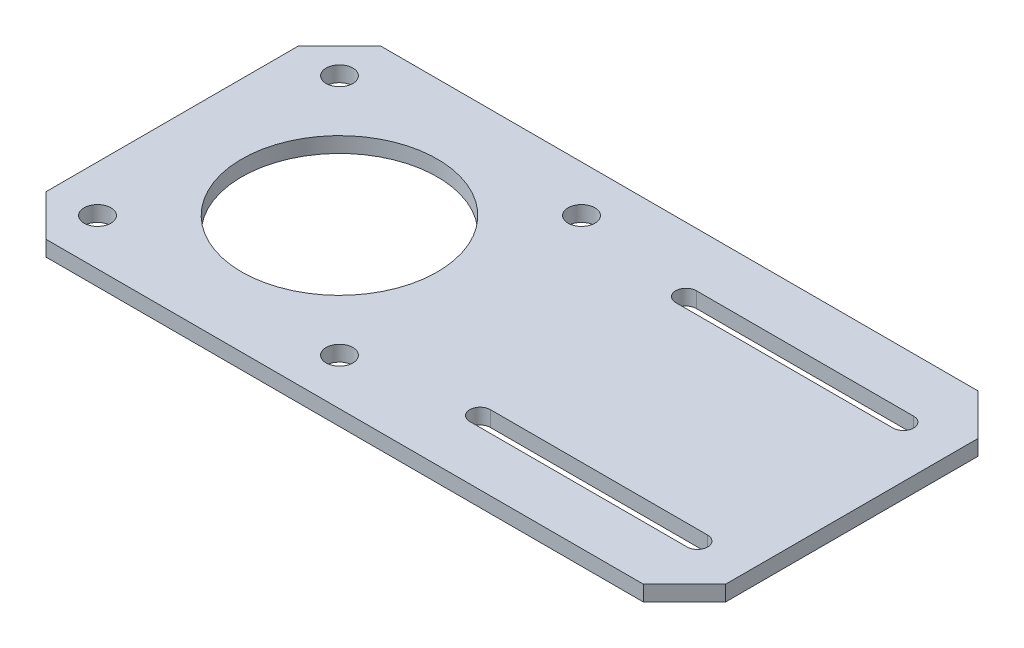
from build123d import *

# Parameters (mm, degrees)
SKETCH1_W             = 132
SKETCH1_H             = 65
MAIN_PLATE_BODY_DEPTH = 3
CHAMFER1_SIZE         = 8
MAIN_MOTOR_HOLE_R     = 19
MAIN_MOTOR_HOLE_R_2   = 2.6
MOTOR_HOLES_DEPTH     = 148.166572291
MOUNTING_SLOTS_DEPTH  = 148.166572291


with BuildPart() as part:
    # Sketch1 → Main Plate Body (new body)
    with BuildSketch(Plane(origin=(0, 0, 0), x_dir=(1, 0, 0), z_dir=(0, 1, 0))):
        with Locations((66, -32.5)):
            Rectangle(SKETCH1_W, SKETCH1_H)
    extrude(amount=MAIN_PLATE_BODY_DEPTH)

    # Chamfer1
    chamfer1_edges = [part.edges().sort_by_distance(p)[0] for p in [
        (0, 1.5, 0),
        (132, 1.5, 0),
        (132, 1.5, 65),
        (0, 1.5, 65),
    ]]
    chamfer(chamfer1_edges, length=CHAMFER1_SIZE)

    # Main Motor Hole → Motor Holes (cut, through all)
    with BuildSketch(Plane(origin=(0, 3, 0), x_dir=(1, 0, 0), z_dir=(0, 1, 0))):
        with Locations(Location((32.5, -32.5, 0), (0, 0, 270))):
            Circle(MAIN_MOTOR_HOLE_R)
        with Locations(Location((9, -56, 0), (0, 0, 270))):
            Circle(MAIN_MOTOR_HOLE_R_2)
        with Locations(Location((56, -56, 0), (0, 0, 90))):
            Circle(MAIN_MOTOR_HOLE_R_2)
        with Locations(Location((56, -9, 0), (0, 0, 270))):
            Circle(MAIN_MOTOR_HOLE_R_2)
        with Locations(Location((9, -9, 0), (0, 0, 90))):
            Circle(MAIN_MOTOR_HOLE_R_2)
    extrude(amount=-MOTOR_HOLES_DEPTH, mode=Mode.SUBTRACT)

    # T-Slot Mounting Slots → Mounting Slots (cut, through all)
    with BuildSketch(Plane(origin=(0, 3, 0), x_dir=(1, 0, 0), z_dir=(0, 1, 0))):
        with BuildLine():
            Line((122, -50.5), (79.8, -50.5))
            ThreePointArc((79.8, -50.5), (77.8, -52.5), (79.8, -54.5))
            Line((79.8, -54.5), (122, -54.5))
            ThreePointArc((122, -54.5), (124, -52.5), (122, -50.5))
        make_face()
        with BuildLine():
            Line((122, -10.5), (79.8, -10.5))
            ThreePointArc((79.8, -10.5), (77.8, -12.5), (79.8, -14.5))
            Line((79.8, -14.5), (122, -14.5))
            ThreePointArc((122, -14.5), (124, -12.5), (122, -10.5))
        make_face()
    extrude(amount=-MOUNTING_SLOTS_DEPTH, mode=Mode.SUBTRACT)


solid = part.part
